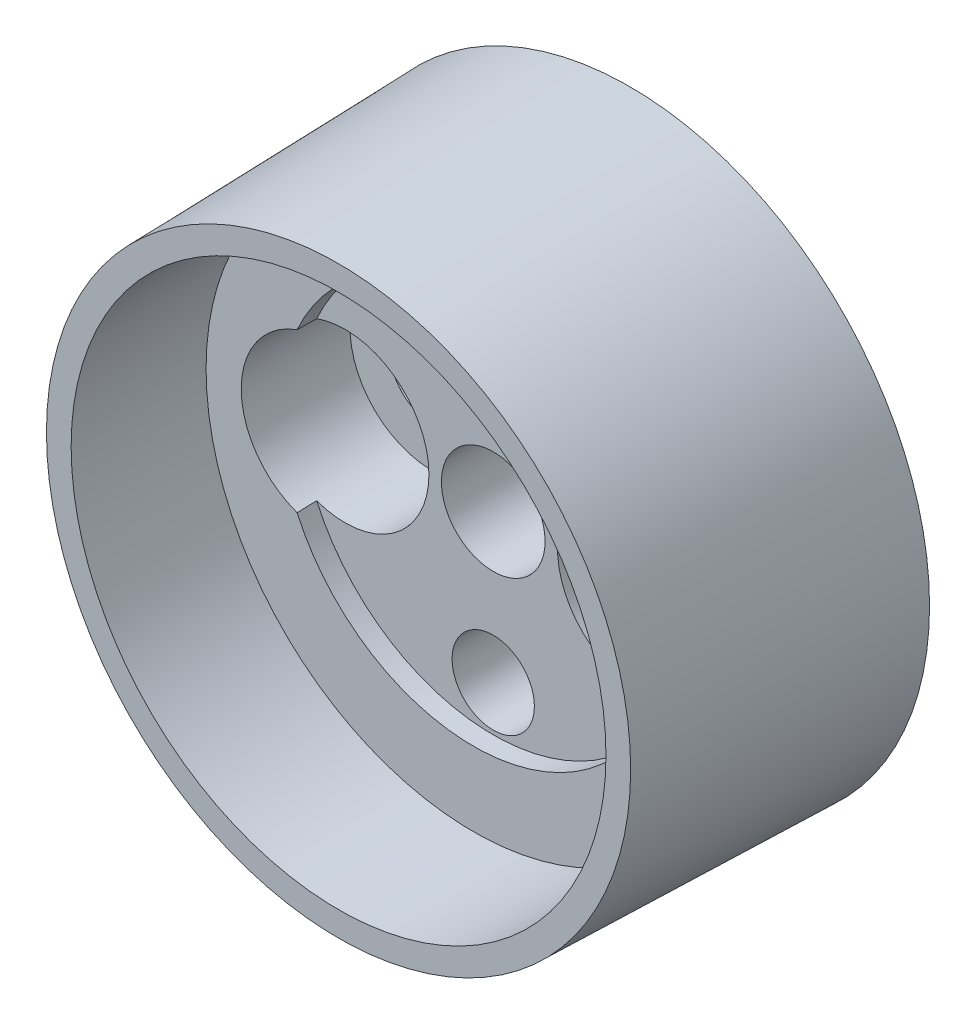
ISO-10303-21;
HEADER;
FILE_DESCRIPTION(('STEP AP214'),'2;1');
FILE_NAME('part.step','',(''),(''),'','','');
FILE_SCHEMA(('AUTOMOTIVE_DESIGN { 1 0 10303 214 1 1 1 1 }'));
ENDSEC;
DATA;
#1=APPLICATION_CONTEXT('core data for automotive mechanical design processes');
#2=APPLICATION_PROTOCOL_DEFINITION('international standard','automotive_design',2000,#1);
#3=PRODUCT_CONTEXT('',#1,'mechanical');
#4=PRODUCT('Part','Part','',(#3));
#5=PRODUCT_RELATED_PRODUCT_CATEGORY('part','',(#4));
#6=PRODUCT_DEFINITION_FORMATION('','',#4);
#7=PRODUCT_DEFINITION_CONTEXT('part definition',#1,'design');
#8=PRODUCT_DEFINITION('design','',#6,#7);
#9=PRODUCT_DEFINITION_SHAPE('','',#8);
#10=(LENGTH_UNIT() NAMED_UNIT(*) SI_UNIT(.MILLI.,.METRE.));
#11=(NAMED_UNIT(*) PLANE_ANGLE_UNIT() SI_UNIT($,.RADIAN.));
#12=(NAMED_UNIT(*) SI_UNIT($,.STERADIAN.) SOLID_ANGLE_UNIT());
#13=UNCERTAINTY_MEASURE_WITH_UNIT(LENGTH_MEASURE(1.E-05),#10,'distance_accuracy_value','');
#14=(GEOMETRIC_REPRESENTATION_CONTEXT(3) GLOBAL_UNCERTAINTY_ASSIGNED_CONTEXT((#13)) GLOBAL_UNIT_ASSIGNED_CONTEXT((#10,
#11,#12)) REPRESENTATION_CONTEXT('',''));
#15=CARTESIAN_POINT('',(0.,0.,0.));
#16=DIRECTION('',(0.,0.,1.));
#17=DIRECTION('',(1.,0.,0.));
#18=AXIS2_PLACEMENT_3D('',#15,#16,#17);
#19=CARTESIAN_POINT('',(0.,0.,17.7));
#20=DIRECTION('',(0.,0.,1.));
#21=DIRECTION('',(1.,0.,0.));
#22=AXIS2_PLACEMENT_3D('',#19,#20,#21);
#23=CYLINDRICAL_SURFACE('',#22,11.75);
#24=CARTESIAN_POINT('',(0.,0.,9.5));
#25=DIRECTION('',(0.,0.,1.));
#26=DIRECTION('',(1.,0.,0.));
#27=AXIS2_PLACEMENT_3D('',#24,#25,#26);
#28=CIRCLE('',#27,11.75);
#29=CARTESIAN_POINT('',(-10.7175026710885,-4.81639247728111,9.5));
#30=VERTEX_POINT('',#29);
#31=CARTESIAN_POINT('',(10.7175026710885,-4.8163924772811,9.5));
#32=VERTEX_POINT('',#31);
#33=EDGE_CURVE('E59',#30,#32,#28,.T.);
#34=ORIENTED_EDGE('',*,*,#33,.T.);
#35=CARTESIAN_POINT('',(10.7174411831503,-4.81652929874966,9.5062));
#36=CARTESIAN_POINT('',(10.7194451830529,-4.81207013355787,9.30413324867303));
#37=CARTESIAN_POINT('',(10.721447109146,-4.80760812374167,9.10206653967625));
#38=CARTESIAN_POINT('',(10.7254468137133,-4.79867841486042,8.69793320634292));
#39=CARTESIAN_POINT('',(10.7274445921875,-4.79421071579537,8.49586658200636));
#40=CARTESIAN_POINT('',(10.7294402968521,-4.78974017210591,8.2938));
#41=B_SPLINE_CURVE_WITH_KNOTS('',3,(#35,#36,#37,#38,#39,#40),.UNSPECIFIED.,.F.,.F.,(4,2,4),(0.,
0.606377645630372,1.21275529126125),.UNSPECIFIED.);
#42=CARTESIAN_POINT('',(10.7293790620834,-4.78987734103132,8.3));
#43=VERTEX_POINT('',#42);
#44=EDGE_CURVE('E68',#32,#43,#41,.T.);
#45=ORIENTED_EDGE('',*,*,#44,.T.);
#46=CARTESIAN_POINT('',(0.,0.,8.3));
#47=DIRECTION('',(0.,0.,1.));
#48=DIRECTION('',(1.,0.,0.));
#49=AXIS2_PLACEMENT_3D('',#46,#47,#48);
#50=CIRCLE('',#49,11.75);
#51=CARTESIAN_POINT('',(-10.7293790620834,-4.78987734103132,8.3));
#52=VERTEX_POINT('',#51);
#53=EDGE_CURVE('E58',#52,#43,#50,.T.);
#54=ORIENTED_EDGE('',*,*,#53,.F.);
#55=CARTESIAN_POINT('',(-10.7294402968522,-4.78974017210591,8.2938));
#56=CARTESIAN_POINT('',(-10.7274445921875,-4.79421071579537,8.49586658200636));
#57=CARTESIAN_POINT('',(-10.7254468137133,-4.79867841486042,8.69793320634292));
#58=CARTESIAN_POINT('',(-10.721447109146,-4.80760812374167,9.10206653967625));
#59=CARTESIAN_POINT('',(-10.7194451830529,-4.81207013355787,9.30413324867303));
#60=CARTESIAN_POINT('',(-10.7174411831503,-4.81652929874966,9.5062));
#61=B_SPLINE_CURVE_WITH_KNOTS('',3,(#55,#56,#57,#58,#59,#60),.UNSPECIFIED.,.F.,.F.,(4,2,4),(0.,
0.606377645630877,1.21275529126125),.UNSPECIFIED.);
#62=EDGE_CURVE('E115',#52,#30,#61,.T.);
#63=ORIENTED_EDGE('',*,*,#62,.T.);
#64=EDGE_LOOP('',(#34,#45,#54,#63));
#65=FACE_BOUND('',#64,.T.);
#66=ADVANCED_FACE('F14',(#65),#23,.F.);
#67=CARTESIAN_POINT('',(10.7175026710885,4.8163924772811,9.5));
#68=VERTEX_POINT('',#67);
#69=CARTESIAN_POINT('',(-10.7175026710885,4.81639247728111,9.5));
#70=VERTEX_POINT('',#69);
#71=EDGE_CURVE('E51',#68,#70,#28,.T.);
#72=ORIENTED_EDGE('',*,*,#71,.T.);
#73=CARTESIAN_POINT('',(-10.7174411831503,4.81652929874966,9.5062));
#74=CARTESIAN_POINT('',(-10.7194451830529,4.81207013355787,9.30413324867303));
#75=CARTESIAN_POINT('',(-10.721447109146,4.80760812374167,9.10206653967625));
#76=CARTESIAN_POINT('',(-10.7254468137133,4.79867841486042,8.69793320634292));
#77=CARTESIAN_POINT('',(-10.7274445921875,4.79421071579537,8.49586658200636));
#78=CARTESIAN_POINT('',(-10.7294402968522,4.78974017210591,8.2938));
#79=B_SPLINE_CURVE_WITH_KNOTS('',3,(#73,#74,#75,#76,#77,#78),.UNSPECIFIED.,.F.,.F.,(4,2,4),(0.,
0.606377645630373,1.21275529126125),.UNSPECIFIED.);
#80=CARTESIAN_POINT('',(-10.7293790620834,4.78987734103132,8.3));
#81=VERTEX_POINT('',#80);
#82=EDGE_CURVE('E29',#70,#81,#79,.T.);
#83=ORIENTED_EDGE('',*,*,#82,.T.);
#84=CARTESIAN_POINT('',(10.7293790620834,4.78987734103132,8.3));
#85=VERTEX_POINT('',#84);
#86=EDGE_CURVE('E72',#85,#81,#50,.T.);
#87=ORIENTED_EDGE('',*,*,#86,.F.);
#88=CARTESIAN_POINT('',(10.7294402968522,4.78974017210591,8.2938));
#89=CARTESIAN_POINT('',(10.7274445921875,4.79421071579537,8.49586658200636));
#90=CARTESIAN_POINT('',(10.7254468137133,4.79867841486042,8.69793320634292));
#91=CARTESIAN_POINT('',(10.721447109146,4.80760812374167,9.10206653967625));
#92=CARTESIAN_POINT('',(10.7194451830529,4.81207013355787,9.30413324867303));
#93=CARTESIAN_POINT('',(10.7174411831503,4.81652929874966,9.5062));
#94=B_SPLINE_CURVE_WITH_KNOTS('',3,(#88,#89,#90,#91,#92,#93),.UNSPECIFIED.,.F.,.F.,(4,2,4),(0.,
0.606377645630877,1.21275529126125),.UNSPECIFIED.);
#95=EDGE_CURVE('E65',#85,#68,#94,.T.);
#96=ORIENTED_EDGE('',*,*,#95,.T.);
#97=EDGE_LOOP('',(#72,#83,#87,#96));
#98=FACE_BOUND('',#97,.T.);
#99=ADVANCED_FACE('F70',(#98),#23,.F.);
#100=CARTESIAN_POINT('',(0.,0.,17.7));
#101=DIRECTION('',(0.,0.,-1.));
#102=DIRECTION('',(-1.,0.,0.));
#103=AXIS2_PLACEMENT_3D('',#100,#101,#102);
#104=CONICAL_SURFACE('',#103,17.75,0.0261799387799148);
#105=CARTESIAN_POINT('',(0.,0.,0.));
#106=DIRECTION('',(0.,0.,1.));
#107=DIRECTION('',(1.,0.,0.));
#108=AXIS2_PLACEMENT_3D('',#105,#106,#107);
#109=CIRCLE('',#108,18.2134908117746);
#110=CARTESIAN_POINT('',(18.2134908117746,0.,0.));
#111=VERTEX_POINT('',#110);
#112=EDGE_CURVE('E150',#111,#111,#109,.T.);
#113=ORIENTED_EDGE('',*,*,#112,.T.);
#114=EDGE_LOOP('',(#113));
#115=FACE_BOUND('',#114,.T.);
#116=CARTESIAN_POINT('',(0.,0.,17.7));
#117=DIRECTION('',(0.,0.,1.));
#118=DIRECTION('',(1.,0.,0.));
#119=AXIS2_PLACEMENT_3D('',#116,#117,#118);
#120=CIRCLE('',#119,17.75);
#121=CARTESIAN_POINT('',(17.75,0.,17.7));
#122=VERTEX_POINT('',#121);
#123=EDGE_CURVE('E134',#122,#122,#120,.T.);
#124=ORIENTED_EDGE('',*,*,#123,.F.);
#125=EDGE_LOOP('',(#124));
#126=FACE_BOUND('',#125,.T.);
#127=ADVANCED_FACE('F16',(#115,#126),#104,.T.);
#128=CARTESIAN_POINT('',(0.,18.2134908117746,0.));
#129=DIRECTION('',(0.,0.,-1.));
#130=DIRECTION('',(-1.,0.,0.));
#131=AXIS2_PLACEMENT_3D('',#128,#129,#130);
#132=PLANE('',#131);
#133=CARTESIAN_POINT('',(0.,0.,0.));
#134=DIRECTION('',(0.,0.,1.));
#135=DIRECTION('',(1.,0.,0.));
#136=AXIS2_PLACEMENT_3D('',#133,#134,#135);
#137=CIRCLE('',#136,3.15);
#138=CARTESIAN_POINT('',(3.15,0.,0.));
#139=VERTEX_POINT('',#138);
#140=EDGE_CURVE('E147',#139,#139,#137,.T.);
#141=ORIENTED_EDGE('',*,*,#140,.T.);
#142=EDGE_LOOP('',(#141));
#143=FACE_BOUND('',#142,.T.);
#144=CARTESIAN_POINT('',(0.,9.,0.));
#145=DIRECTION('',(0.,0.,1.));
#146=DIRECTION('',(1.,0.,0.));
#147=AXIS2_PLACEMENT_3D('',#144,#145,#146);
#148=CIRCLE('',#147,2.5);
#149=CARTESIAN_POINT('',(2.5,9.,0.));
#150=VERTEX_POINT('',#149);
#151=EDGE_CURVE('E131',#150,#150,#148,.T.);
#152=ORIENTED_EDGE('',*,*,#151,.T.);
#153=EDGE_LOOP('',(#152));
#154=FACE_BOUND('',#153,.T.);
#155=CARTESIAN_POINT('',(9.,0.,0.));
#156=DIRECTION('',(0.,0.,1.));
#157=DIRECTION('',(1.,0.,0.));
#158=AXIS2_PLACEMENT_3D('',#155,#156,#157);
#159=CIRCLE('',#158,2.5);
#160=CARTESIAN_POINT('',(11.5,0.,0.));
#161=VERTEX_POINT('',#160);
#162=EDGE_CURVE('E73',#161,#161,#159,.T.);
#163=ORIENTED_EDGE('',*,*,#162,.T.);
#164=EDGE_LOOP('',(#163));
#165=FACE_BOUND('',#164,.T.);
#166=CARTESIAN_POINT('',(-9.,0.,0.));
#167=DIRECTION('',(0.,0.,1.));
#168=DIRECTION('',(1.,0.,0.));
#169=AXIS2_PLACEMENT_3D('',#166,#167,#168);
#170=CIRCLE('',#169,2.5);
#171=CARTESIAN_POINT('',(-6.5,0.,0.));
#172=VERTEX_POINT('',#171);
#173=EDGE_CURVE('E208',#172,#172,#170,.T.);
#174=ORIENTED_EDGE('',*,*,#173,.T.);
#175=EDGE_LOOP('',(#174));
#176=FACE_BOUND('',#175,.T.);
#177=CARTESIAN_POINT('',(0.,-9.,0.));
#178=DIRECTION('',(0.,0.,1.));
#179=DIRECTION('',(1.,0.,0.));
#180=AXIS2_PLACEMENT_3D('',#177,#178,#179);
#181=CIRCLE('',#180,2.5);
#182=CARTESIAN_POINT('',(2.5,-9.,0.));
#183=VERTEX_POINT('',#182);
#184=EDGE_CURVE('E128',#183,#183,#181,.T.);
#185=ORIENTED_EDGE('',*,*,#184,.T.);
#186=EDGE_LOOP('',(#185));
#187=FACE_BOUND('',#186,.T.);
#188=ORIENTED_EDGE('',*,*,#112,.F.);
#189=EDGE_LOOP('',(#188));
#190=FACE_BOUND('',#189,.T.);
#191=ADVANCED_FACE('F171',(#143,#154,#165,#176,#187,#190),#132,.T.);
#192=CARTESIAN_POINT('',(0.,0.,17.7));
#193=DIRECTION('',(0.,0.,1.));
#194=DIRECTION('',(1.,0.,0.));
#195=AXIS2_PLACEMENT_3D('',#192,#193,#194);
#196=CYLINDRICAL_SURFACE('',#195,3.15);
#197=CARTESIAN_POINT('',(0.,0.,8.3));
#198=DIRECTION('',(0.,0.,1.));
#199=DIRECTION('',(1.,0.,0.));
#200=AXIS2_PLACEMENT_3D('',#197,#198,#199);
#201=CIRCLE('',#200,3.15);
#202=CARTESIAN_POINT('',(3.15,0.,8.3));
#203=VERTEX_POINT('',#202);
#204=EDGE_CURVE('E144',#203,#203,#201,.T.);
#205=ORIENTED_EDGE('',*,*,#204,.T.);
#206=EDGE_LOOP('',(#205));
#207=FACE_BOUND('',#206,.T.);
#208=ORIENTED_EDGE('',*,*,#140,.F.);
#209=EDGE_LOOP('',(#208));
#210=FACE_BOUND('',#209,.T.);
#211=ADVANCED_FACE('F174',(#207,#210),#196,.F.);
#212=CARTESIAN_POINT('',(0.,3.15,8.3));
#213=DIRECTION('',(0.,0.,1.));
#214=DIRECTION('',(1.,0.,0.));
#215=AXIS2_PLACEMENT_3D('',#212,#213,#214);
#216=PLANE('',#215);
#217=CARTESIAN_POINT('',(9.,0.,8.3));
#218=DIRECTION('',(0.,0.,1.));
#219=DIRECTION('',(1.,0.,0.));
#220=AXIS2_PLACEMENT_3D('',#217,#218,#219);
#221=CIRCLE('',#220,5.09251184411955);
#222=EDGE_CURVE('E75',#43,#85,#221,.F.);
#223=ORIENTED_EDGE('',*,*,#222,.T.);
#224=ORIENTED_EDGE('',*,*,#86,.T.);
#225=CARTESIAN_POINT('',(-9.,0.,8.3));
#226=DIRECTION('',(0.,0.,1.));
#227=DIRECTION('',(1.,0.,0.));
#228=AXIS2_PLACEMENT_3D('',#225,#226,#227);
#229=CIRCLE('',#228,5.09251184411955);
#230=EDGE_CURVE('E34',#81,#52,#229,.F.);
#231=ORIENTED_EDGE('',*,*,#230,.T.);
#232=ORIENTED_EDGE('',*,*,#53,.T.);
#233=EDGE_LOOP('',(#223,#224,#231,#232));
#234=FACE_BOUND('',#233,.T.);
#235=CARTESIAN_POINT('',(0.,9.,8.3));
#236=DIRECTION('',(0.,0.,1.));
#237=DIRECTION('',(1.,0.,0.));
#238=AXIS2_PLACEMENT_3D('',#235,#236,#237);
#239=CIRCLE('',#238,2.5);
#240=CARTESIAN_POINT('',(2.5,9.,8.3));
#241=VERTEX_POINT('',#240);
#242=EDGE_CURVE('E153',#241,#241,#239,.F.);
#243=ORIENTED_EDGE('',*,*,#242,.T.);
#244=EDGE_LOOP('',(#243));
#245=FACE_BOUND('',#244,.T.);
#246=CARTESIAN_POINT('',(0.,-9.,8.3));
#247=DIRECTION('',(0.,0.,1.));
#248=DIRECTION('',(1.,0.,0.));
#249=AXIS2_PLACEMENT_3D('',#246,#247,#248);
#250=CIRCLE('',#249,2.5);
#251=CARTESIAN_POINT('',(2.5,-9.,8.3));
#252=VERTEX_POINT('',#251);
#253=EDGE_CURVE('E156',#252,#252,#250,.F.);
#254=ORIENTED_EDGE('',*,*,#253,.T.);
#255=EDGE_LOOP('',(#254));
#256=FACE_BOUND('',#255,.T.);
#257=ORIENTED_EDGE('',*,*,#204,.F.);
#258=EDGE_LOOP('',(#257));
#259=FACE_BOUND('',#258,.T.);
#260=ADVANCED_FACE('F160',(#234,#245,#256,#259),#216,.T.);
#261=CARTESIAN_POINT('',(0.,11.75,9.5));
#262=DIRECTION('',(0.,0.,1.));
#263=DIRECTION('',(1.,0.,0.));
#264=AXIS2_PLACEMENT_3D('',#261,#262,#263);
#265=PLANE('',#264);
#266=CARTESIAN_POINT('',(0.,0.,9.5));
#267=DIRECTION('',(0.,0.,1.));
#268=DIRECTION('',(1.,0.,0.));
#269=AXIS2_PLACEMENT_3D('',#266,#267,#268);
#270=CIRCLE('',#269,16.25);
#271=CARTESIAN_POINT('',(16.25,0.,9.5));
#272=VERTEX_POINT('',#271);
#273=EDGE_CURVE('E140',#272,#272,#270,.T.);
#274=ORIENTED_EDGE('',*,*,#273,.T.);
#275=EDGE_LOOP('',(#274));
#276=FACE_BOUND('',#275,.T.);
#277=CARTESIAN_POINT('',(9.,0.,9.5));
#278=DIRECTION('',(0.,0.,1.));
#279=DIRECTION('',(1.,0.,0.));
#280=AXIS2_PLACEMENT_3D('',#277,#278,#279);
#281=CIRCLE('',#280,5.11345792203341);
#282=EDGE_CURVE('E9',#68,#32,#281,.F.);
#283=ORIENTED_EDGE('',*,*,#282,.T.);
#284=ORIENTED_EDGE('',*,*,#33,.F.);
#285=CARTESIAN_POINT('',(-9.,0.,9.5));
#286=DIRECTION('',(0.,0.,1.));
#287=DIRECTION('',(1.,0.,0.));
#288=AXIS2_PLACEMENT_3D('',#285,#286,#287);
#289=CIRCLE('',#288,5.11345792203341);
#290=EDGE_CURVE('E22',#30,#70,#289,.F.);
#291=ORIENTED_EDGE('',*,*,#290,.T.);
#292=ORIENTED_EDGE('',*,*,#71,.F.);
#293=EDGE_LOOP('',(#283,#284,#291,#292));
#294=FACE_BOUND('',#293,.T.);
#295=ADVANCED_FACE('F53',(#276,#294),#265,.T.);
#296=CARTESIAN_POINT('',(0.,0.,17.7));
#297=DIRECTION('',(0.,0.,1.));
#298=DIRECTION('',(1.,0.,0.));
#299=AXIS2_PLACEMENT_3D('',#296,#297,#298);
#300=CYLINDRICAL_SURFACE('',#299,16.25);
#301=CARTESIAN_POINT('',(0.,0.,17.7));
#302=DIRECTION('',(0.,0.,1.));
#303=DIRECTION('',(1.,0.,0.));
#304=AXIS2_PLACEMENT_3D('',#301,#302,#303);
#305=CIRCLE('',#304,16.25);
#306=CARTESIAN_POINT('',(16.25,0.,17.7));
#307=VERTEX_POINT('',#306);
#308=EDGE_CURVE('E137',#307,#307,#305,.T.);
#309=ORIENTED_EDGE('',*,*,#308,.T.);
#310=EDGE_LOOP('',(#309));
#311=FACE_BOUND('',#310,.T.);
#312=ORIENTED_EDGE('',*,*,#273,.F.);
#313=EDGE_LOOP('',(#312));
#314=FACE_BOUND('',#313,.T.);
#315=ADVANCED_FACE('F185',(#311,#314),#300,.F.);
#316=CARTESIAN_POINT('',(0.,16.25,17.7));
#317=DIRECTION('',(0.,0.,1.));
#318=DIRECTION('',(1.,0.,0.));
#319=AXIS2_PLACEMENT_3D('',#316,#317,#318);
#320=PLANE('',#319);
#321=ORIENTED_EDGE('',*,*,#123,.T.);
#322=EDGE_LOOP('',(#321));
#323=FACE_BOUND('',#322,.T.);
#324=ORIENTED_EDGE('',*,*,#308,.F.);
#325=EDGE_LOOP('',(#324));
#326=FACE_BOUND('',#325,.T.);
#327=ADVANCED_FACE('F182',(#323,#326),#320,.T.);
#328=CARTESIAN_POINT('',(0.,9.,18.));
#329=DIRECTION('',(0.,0.,1.));
#330=DIRECTION('',(1.,0.,0.));
#331=AXIS2_PLACEMENT_3D('',#328,#329,#330);
#332=CYLINDRICAL_SURFACE('',#331,2.5);
#333=ORIENTED_EDGE('',*,*,#242,.F.);
#334=EDGE_LOOP('',(#333));
#335=FACE_BOUND('',#334,.T.);
#336=ORIENTED_EDGE('',*,*,#151,.F.);
#337=EDGE_LOOP('',(#336));
#338=FACE_BOUND('',#337,.T.);
#339=ADVANCED_FACE('F167',(#335,#338),#332,.F.);
#340=CARTESIAN_POINT('',(0.,-9.,18.));
#341=DIRECTION('',(0.,0.,1.));
#342=DIRECTION('',(1.,0.,0.));
#343=AXIS2_PLACEMENT_3D('',#340,#341,#342);
#344=CYLINDRICAL_SURFACE('',#343,2.5);
#345=ORIENTED_EDGE('',*,*,#253,.F.);
#346=EDGE_LOOP('',(#345));
#347=FACE_BOUND('',#346,.T.);
#348=ORIENTED_EDGE('',*,*,#184,.F.);
#349=EDGE_LOOP('',(#348));
#350=FACE_BOUND('',#349,.T.);
#351=ADVANCED_FACE('F163',(#347,#350),#344,.F.);
#352=CARTESIAN_POINT('',(-9.,0.,0.));
#353=DIRECTION('',(0.,0.,1.));
#354=DIRECTION('',(1.,0.,0.));
#355=AXIS2_PLACEMENT_3D('',#352,#353,#354);
#356=CONICAL_SURFACE('',#355,2.5,0.026179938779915);
#357=CARTESIAN_POINT('',(-9.,0.,3.));
#358=DIRECTION('',(0.,0.,1.));
#359=DIRECTION('',(1.,0.,0.));
#360=AXIS2_PLACEMENT_3D('',#357,#358,#359);
#361=CIRCLE('',#360,2.57855776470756);
#362=CARTESIAN_POINT('',(-6.42144223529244,0.,3.));
#363=VERTEX_POINT('',#362);
#364=EDGE_CURVE('E210',#363,#363,#361,.T.);
#365=ORIENTED_EDGE('',*,*,#364,.T.);
#366=EDGE_LOOP('',(#365));
#367=FACE_BOUND('',#366,.T.);
#368=ORIENTED_EDGE('',*,*,#173,.F.);
#369=EDGE_LOOP('',(#368));
#370=FACE_BOUND('',#369,.T.);
#371=ADVANCED_FACE('F166',(#367,#370),#356,.F.);
#372=CARTESIAN_POINT('',(-6.42144223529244,0.,3.));
#373=DIRECTION('',(0.,0.,1.));
#374=DIRECTION('',(1.,0.,0.));
#375=AXIS2_PLACEMENT_3D('',#372,#373,#374);
#376=PLANE('',#375);
#377=CARTESIAN_POINT('',(-9.,0.,3.));
#378=DIRECTION('',(0.,0.,1.));
#379=DIRECTION('',(1.,0.,0.));
#380=AXIS2_PLACEMENT_3D('',#377,#378,#379);
#381=CIRCLE('',#380,5.);
#382=CARTESIAN_POINT('',(-4.,0.,3.));
#383=VERTEX_POINT('',#382);
#384=EDGE_CURVE('E214',#383,#383,#381,.T.);
#385=ORIENTED_EDGE('',*,*,#384,.T.);
#386=EDGE_LOOP('',(#385));
#387=FACE_BOUND('',#386,.T.);
#388=ORIENTED_EDGE('',*,*,#364,.F.);
#389=EDGE_LOOP('',(#388));
#390=FACE_BOUND('',#389,.T.);
#391=ADVANCED_FACE('F111',(#387,#390),#376,.T.);
#392=CARTESIAN_POINT('',(-9.,0.,3.));
#393=DIRECTION('',(0.,0.,1.));
#394=DIRECTION('',(1.,0.,0.));
#395=AXIS2_PLACEMENT_3D('',#392,#393,#394);
#396=CONICAL_SURFACE('',#395,5.,0.0174532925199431);
#397=ORIENTED_EDGE('',*,*,#230,.F.);
#398=ORIENTED_EDGE('',*,*,#82,.F.);
#399=ORIENTED_EDGE('',*,*,#290,.F.);
#400=ORIENTED_EDGE('',*,*,#62,.F.);
#401=EDGE_LOOP('',(#397,#398,#399,#400));
#402=FACE_BOUND('',#401,.T.);
#403=ORIENTED_EDGE('',*,*,#384,.F.);
#404=EDGE_LOOP('',(#403));
#405=FACE_BOUND('',#404,.T.);
#406=ADVANCED_FACE('F106',(#402,#405),#396,.F.);
#407=CARTESIAN_POINT('',(9.,0.,0.));
#408=DIRECTION('',(0.,0.,1.));
#409=DIRECTION('',(1.,0.,0.));
#410=AXIS2_PLACEMENT_3D('',#407,#408,#409);
#411=CONICAL_SURFACE('',#410,2.5,0.026179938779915);
#412=CARTESIAN_POINT('',(9.,0.,3.));
#413=DIRECTION('',(0.,0.,1.));
#414=DIRECTION('',(1.,0.,0.));
#415=AXIS2_PLACEMENT_3D('',#412,#413,#414);
#416=CIRCLE('',#415,2.57855776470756);
#417=CARTESIAN_POINT('',(11.5785577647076,0.,3.));
#418=VERTEX_POINT('',#417);
#419=EDGE_CURVE('E78',#418,#418,#416,.T.);
#420=ORIENTED_EDGE('',*,*,#419,.T.);
#421=EDGE_LOOP('',(#420));
#422=FACE_BOUND('',#421,.T.);
#423=ORIENTED_EDGE('',*,*,#162,.F.);
#424=EDGE_LOOP('',(#423));
#425=FACE_BOUND('',#424,.T.);
#426=ADVANCED_FACE('F102',(#422,#425),#411,.F.);
#427=CARTESIAN_POINT('',(11.5785577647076,0.,3.));
#428=DIRECTION('',(0.,0.,1.));
#429=DIRECTION('',(1.,0.,0.));
#430=AXIS2_PLACEMENT_3D('',#427,#428,#429);
#431=PLANE('',#430);
#432=CARTESIAN_POINT('',(9.,0.,3.));
#433=DIRECTION('',(0.,0.,1.));
#434=DIRECTION('',(1.,0.,0.));
#435=AXIS2_PLACEMENT_3D('',#432,#433,#434);
#436=CIRCLE('',#435,5.);
#437=CARTESIAN_POINT('',(14.,0.,3.));
#438=VERTEX_POINT('',#437);
#439=EDGE_CURVE('E352',#438,#438,#436,.T.);
#440=ORIENTED_EDGE('',*,*,#439,.T.);
#441=EDGE_LOOP('',(#440));
#442=FACE_BOUND('',#441,.T.);
#443=ORIENTED_EDGE('',*,*,#419,.F.);
#444=EDGE_LOOP('',(#443));
#445=FACE_BOUND('',#444,.T.);
#446=ADVANCED_FACE('F98',(#442,#445),#431,.T.);
#447=CARTESIAN_POINT('',(9.,0.,3.));
#448=DIRECTION('',(0.,0.,1.));
#449=DIRECTION('',(1.,0.,0.));
#450=AXIS2_PLACEMENT_3D('',#447,#448,#449);
#451=CONICAL_SURFACE('',#450,5.,0.0174532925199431);
#452=ORIENTED_EDGE('',*,*,#44,.F.);
#453=ORIENTED_EDGE('',*,*,#282,.F.);
#454=ORIENTED_EDGE('',*,*,#95,.F.);
#455=ORIENTED_EDGE('',*,*,#222,.F.);
#456=EDGE_LOOP('',(#452,#453,#454,#455));
#457=FACE_BOUND('',#456,.T.);
#458=ORIENTED_EDGE('',*,*,#439,.F.);
#459=EDGE_LOOP('',(#458));
#460=FACE_BOUND('',#459,.T.);
#461=ADVANCED_FACE('F63',(#457,#460),#451,.F.);
#462=CLOSED_SHELL('',(#66,#99,#127,#191,#211,#260,#295,#315,#327,#339,#351,#371,#391,#406,#426,
#446,#461));
#463=MANIFOLD_SOLID_BREP('B1',#462);
#464=ADVANCED_BREP_SHAPE_REPRESENTATION('',(#18,#463),#14);
#465=SHAPE_DEFINITION_REPRESENTATION(#9,#464);
ENDSEC;
END-ISO-10303-21;
